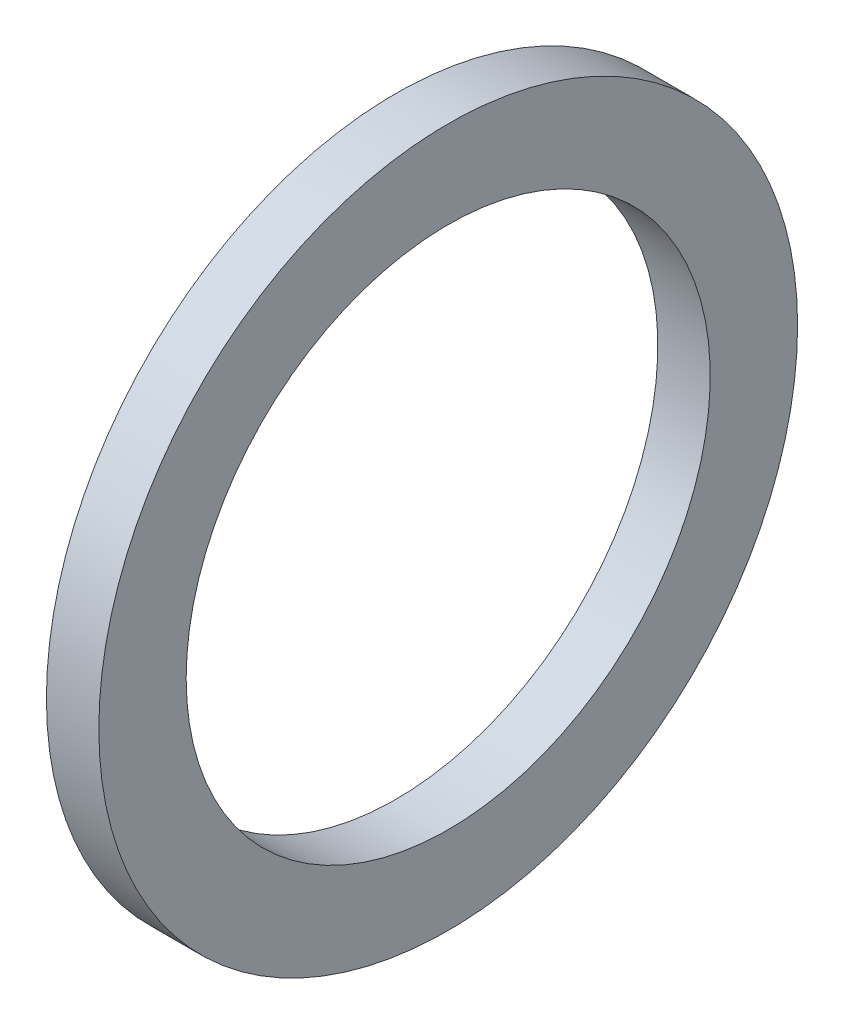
ISO-10303-21;
HEADER;
FILE_DESCRIPTION(('STEP AP214'),'2;1');
FILE_NAME('part.step','',(''),(''),'','','');
FILE_SCHEMA(('AUTOMOTIVE_DESIGN { 1 0 10303 214 1 1 1 1 }'));
ENDSEC;
DATA;
#1=APPLICATION_CONTEXT('core data for automotive mechanical design processes');
#2=APPLICATION_PROTOCOL_DEFINITION('international standard','automotive_design',2000,#1);
#3=PRODUCT_CONTEXT('',#1,'mechanical');
#4=PRODUCT('Part','Part','',(#3));
#5=PRODUCT_RELATED_PRODUCT_CATEGORY('part','',(#4));
#6=PRODUCT_DEFINITION_FORMATION('','',#4);
#7=PRODUCT_DEFINITION_CONTEXT('part definition',#1,'design');
#8=PRODUCT_DEFINITION('design','',#6,#7);
#9=PRODUCT_DEFINITION_SHAPE('','',#8);
#10=(LENGTH_UNIT() NAMED_UNIT(*) SI_UNIT(.MILLI.,.METRE.));
#11=(NAMED_UNIT(*) PLANE_ANGLE_UNIT() SI_UNIT($,.RADIAN.));
#12=(NAMED_UNIT(*) SI_UNIT($,.STERADIAN.) SOLID_ANGLE_UNIT());
#13=UNCERTAINTY_MEASURE_WITH_UNIT(LENGTH_MEASURE(1.E-05),#10,'distance_accuracy_value','');
#14=(GEOMETRIC_REPRESENTATION_CONTEXT(3) GLOBAL_UNCERTAINTY_ASSIGNED_CONTEXT((#13)) GLOBAL_UNIT_ASSIGNED_CONTEXT((#10,
#11,#12)) REPRESENTATION_CONTEXT('',''));
#15=CARTESIAN_POINT('',(0.,0.,0.));
#16=DIRECTION('',(0.,0.,1.));
#17=DIRECTION('',(1.,0.,0.));
#18=AXIS2_PLACEMENT_3D('',#15,#16,#17);
#19=CARTESIAN_POINT('',(-4.61097130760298,5.95104244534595,0.));
#20=DIRECTION('',(1.,0.,0.));
#21=DIRECTION('',(0.,0.,-1.));
#22=AXIS2_PLACEMENT_3D('',#19,#20,#21);
#23=PLANE('',#22);
#24=CARTESIAN_POINT('',(-4.61097130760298,-1.54895755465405,0.));
#25=DIRECTION('',(-1.,0.,0.));
#26=DIRECTION('',(0.,0.,1.));
#27=AXIS2_PLACEMENT_3D('',#24,#25,#26);
#28=CIRCLE('',#27,7.5);
#29=CARTESIAN_POINT('',(-4.61097130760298,-1.54895755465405,7.5));
#30=VERTEX_POINT('',#29);
#31=EDGE_CURVE('E45',#30,#30,#28,.T.);
#32=ORIENTED_EDGE('',*,*,#31,.F.);
#33=EDGE_LOOP('',(#32));
#34=FACE_BOUND('',#33,.T.);
#35=CARTESIAN_POINT('',(-4.61097130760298,-1.54895755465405,0.));
#36=DIRECTION('',(-1.,0.,0.));
#37=DIRECTION('',(0.,0.,1.));
#38=AXIS2_PLACEMENT_3D('',#35,#36,#37);
#39=CIRCLE('',#38,10.);
#40=CARTESIAN_POINT('',(-4.61097130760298,-1.54895755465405,10.));
#41=VERTEX_POINT('',#40);
#42=EDGE_CURVE('E10',#41,#41,#39,.T.);
#43=ORIENTED_EDGE('',*,*,#42,.T.);
#44=EDGE_LOOP('',(#43));
#45=FACE_BOUND('',#44,.T.);
#46=ADVANCED_FACE('F31',(#34,#45),#23,.F.);
#47=CARTESIAN_POINT('',(-9.91582329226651,-1.54895755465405,0.));
#48=DIRECTION('',(-1.,0.,0.));
#49=DIRECTION('',(0.,0.,1.));
#50=AXIS2_PLACEMENT_3D('',#47,#48,#49);
#51=CYLINDRICAL_SURFACE('',#50,10.);
#52=ORIENTED_EDGE('',*,*,#42,.F.);
#53=EDGE_LOOP('',(#52));
#54=FACE_BOUND('',#53,.T.);
#55=CARTESIAN_POINT('',(-3.11097130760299,-1.54895755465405,0.));
#56=DIRECTION('',(-1.,0.,0.));
#57=DIRECTION('',(0.,0.,1.));
#58=AXIS2_PLACEMENT_3D('',#55,#56,#57);
#59=CIRCLE('',#58,10.);
#60=CARTESIAN_POINT('',(-3.11097130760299,-1.54895755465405,10.));
#61=VERTEX_POINT('',#60);
#62=EDGE_CURVE('E37',#61,#61,#59,.T.);
#63=ORIENTED_EDGE('',*,*,#62,.T.);
#64=EDGE_LOOP('',(#63));
#65=FACE_BOUND('',#64,.T.);
#66=ADVANCED_FACE('F54',(#54,#65),#51,.T.);
#67=CARTESIAN_POINT('',(-3.11097130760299,8.45104244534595,0.));
#68=DIRECTION('',(-1.,0.,0.));
#69=DIRECTION('',(0.,0.,1.));
#70=AXIS2_PLACEMENT_3D('',#67,#68,#69);
#71=PLANE('',#70);
#72=ORIENTED_EDGE('',*,*,#62,.F.);
#73=EDGE_LOOP('',(#72));
#74=FACE_BOUND('',#73,.T.);
#75=CARTESIAN_POINT('',(-3.11097130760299,-1.54895755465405,0.));
#76=DIRECTION('',(-1.,0.,0.));
#77=DIRECTION('',(0.,0.,1.));
#78=AXIS2_PLACEMENT_3D('',#75,#76,#77);
#79=CIRCLE('',#78,7.5);
#80=CARTESIAN_POINT('',(-3.11097130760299,-1.54895755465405,7.5));
#81=VERTEX_POINT('',#80);
#82=EDGE_CURVE('E41',#81,#81,#79,.T.);
#83=ORIENTED_EDGE('',*,*,#82,.T.);
#84=EDGE_LOOP('',(#83));
#85=FACE_BOUND('',#84,.T.);
#86=ADVANCED_FACE('F58',(#74,#85),#71,.F.);
#87=CARTESIAN_POINT('',(-9.91582329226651,-1.54895755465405,0.));
#88=DIRECTION('',(-1.,0.,0.));
#89=DIRECTION('',(0.,0.,1.));
#90=AXIS2_PLACEMENT_3D('',#87,#88,#89);
#91=CYLINDRICAL_SURFACE('',#90,7.5);
#92=ORIENTED_EDGE('',*,*,#82,.F.);
#93=EDGE_LOOP('',(#92));
#94=FACE_BOUND('',#93,.T.);
#95=ORIENTED_EDGE('',*,*,#31,.T.);
#96=EDGE_LOOP('',(#95));
#97=FACE_BOUND('',#96,.T.);
#98=ADVANCED_FACE('F51',(#94,#97),#91,.F.);
#99=CLOSED_SHELL('',(#46,#66,#86,#98));
#100=MANIFOLD_SOLID_BREP('B2',#99);
#101=ADVANCED_BREP_SHAPE_REPRESENTATION('',(#18,#100),#14);
#102=SHAPE_DEFINITION_REPRESENTATION(#9,#101);
ENDSEC;
END-ISO-10303-21;
